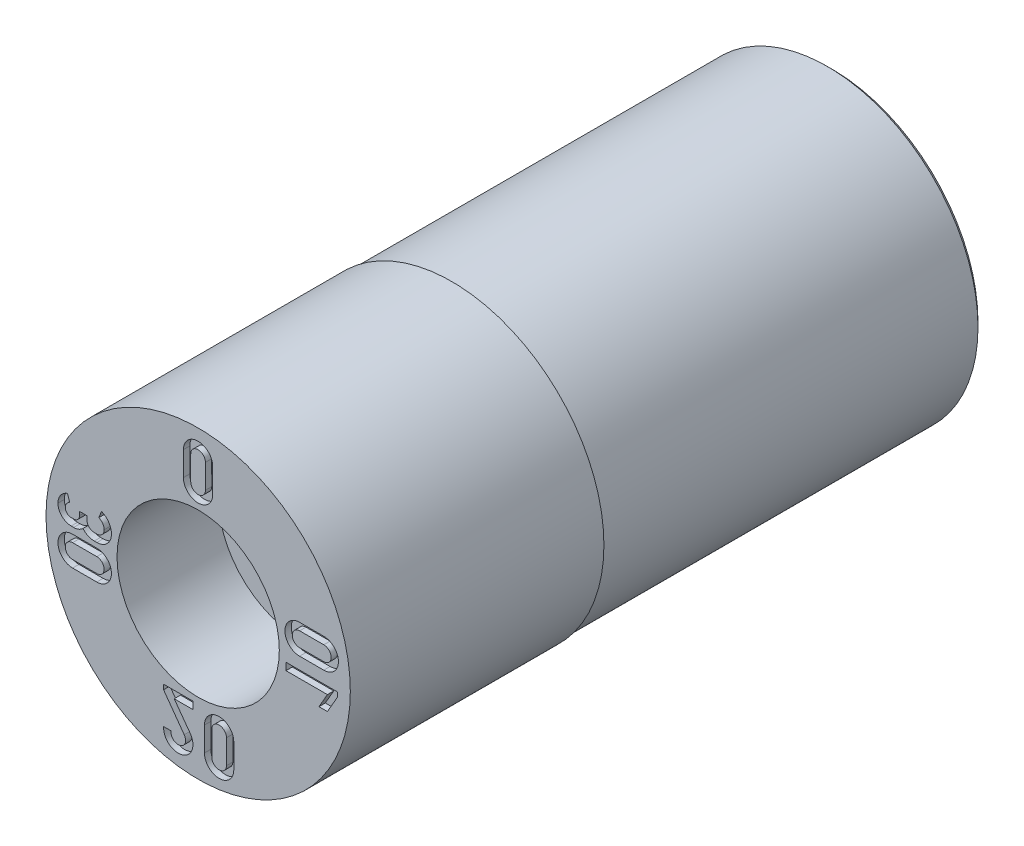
from build123d import *

# Parameters (mm, degrees)
SKETCH4_W          = 15
SKETCH4_H          = 1
CUT_EXTRUDE1_DEPTH = 0.25
CUT_EXTRUDE2_DEPTH = 3


with BuildPart() as part:
    # Sketch1 → Revolve1 (revolve)
    with BuildSketch(Plane(origin=(0, 0, 0), x_dir=(0, 0, -1), z_dir=(1, 0, 0)), mode=Mode.PRIVATE) as revolve1_sk:
        Polygon((0, 6), (0, 3.2), (4, 3.2), (4, 1.5), (19, 1.5), (19, 3), (25, 3), (25, 5.75), (24.75, 6), align=None)
    revolve(revolve1_sk.sketch.rotate(Axis((0, 0, 3.797909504), (0, 0, -1)), 90), axis=Axis((0, 0, 3.797909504), (0, 0, -1)))

    # Sketch4 → Cut-Revolve1 (revolve, cut)
    with BuildSketch(Plane(origin=(0, 0, 0), x_dir=(0, 0, -1), z_dir=(1, 0, 0)), mode=Mode.PRIVATE) as cut_revolve1_sk:
        with Locations((17.5, 6.435)):
            Rectangle(SKETCH4_W, SKETCH4_H)
    revolve(cut_revolve1_sk.sketch.rotate(Axis((0, 0, 0), (0, 0, -1)), 90), axis=Axis((0, 0, 0), (0, 0, -1)), mode=Mode.SUBTRACT)

    # Sketch2 → Cut-Extrude1 (cut)
    # profile 1 of 7: a face of its own
    with BuildSketch(Plane.XY):
        with BuildLine():
            Line((1.404681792, -4.976427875), (1.404763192, -4.022448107))
            ThreePointArc((1.404763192, -4.022448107), (0.826381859, -3.444103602), (0.248064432, -4.02251201))
            Line((0.248064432, -4.02251201), (0.248144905, -4.976525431))
            ThreePointArc((0.248144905, -4.976525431), (0.826462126, -5.554745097), (1.404681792, -4.976427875))
        make_face()
        with BuildLine():
            Line((0.537279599, -4.022487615), (0.537360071, -4.976501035))
            ThreePointArc((0.537360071, -4.976501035), (0.82643773, -5.26552993), (1.115466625, -4.976452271))
            Line((1.115466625, -4.976452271), (1.115548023, -4.02241835))
            ThreePointArc((1.115548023, -4.02241835), (0.826379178, -3.73331877), (0.537279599, -4.022487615))
        make_face(mode=Mode.SUBTRACT)
    # profile 2 of 7: a face of its own
    with BuildSketch(Plane.XY):
        with BuildLine():
            Line((-3.996502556, 0.377197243), (-4.097685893, 0.377205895))
            ThreePointArc((-4.097685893, 0.377205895), (-4.302045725, 0.461874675), (-4.386679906, 0.666248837))
            Line((-4.386679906, 0.666248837), (-4.38666755, 0.810770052))
            Line((-4.38666755, 0.810770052), (-4.675801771, 0.810794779))
            Line((-4.675801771, 0.810794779), (-4.675814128, 0.666308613))
            ThreePointArc((-4.675814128, 0.666308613), (-4.743562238, 0.50278972), (-4.907092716, 0.43506958))
            Line((-4.907092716, 0.43506958), (-5.008262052, 0.435078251))
            ThreePointArc((-5.008262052, 0.435078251), (-5.171723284, 0.502883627), (-5.23951242, 0.666351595))
            ThreePointArc((-5.23951242, 0.666351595), (-5.190773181, 0.81807853), (-5.062626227, 0.912814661))
            Line((-5.062626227, 0.912814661), (-5.155123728, 1.18674264))
            ThreePointArc((-5.155123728, 1.18674264), (-5.425530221, 0.986635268), (-5.528612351, 0.666421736))
            ThreePointArc((-5.528612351, 0.666421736), (-5.376258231, 0.298385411), (-5.008258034, 0.145944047))
            Line((-5.008258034, 0.145944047), (-4.907117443, 0.145935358))
            ThreePointArc((-4.907117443, 0.145935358), (-4.709605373, 0.18487619), (-4.541673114, 0.295899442))
            ThreePointArc((-4.541673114, 0.295899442), (-4.34281211, 0.142582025), (-4.097698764, 0.088071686))
            Line((-4.097698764, 0.088071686), (-3.996478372, 0.088063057))
            ThreePointArc((-3.996478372, 0.088063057), (-3.587664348, 0.257375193), (-3.418339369, 0.666183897))
            ThreePointArc((-3.418339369, 0.666183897), (-3.52602414, 1.015866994), (-3.811743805, 1.244424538))
            Line((-3.811743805, 1.244424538), (-3.917838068, 0.975585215))
            ThreePointArc((-3.917838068, 0.975585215), (-3.764984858, 0.85332605), (-3.707392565, 0.666257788))
            ThreePointArc((-3.707392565, 0.666257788), (-3.792081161, 0.461850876), (-3.996502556, 0.377197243))
        make_face()
    # profile 3 of 7: a face of its own
    with BuildSketch(Plane.XY):
        with BuildLine():
            Line((4.95360659, 1.3606148), (3.999616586, 1.360533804))
            ThreePointArc((3.999616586, 1.360533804), (3.421397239, 0.782227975), (3.999691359, 0.203996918))
            Line((3.999691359, 0.203996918), (4.95370478, 0.204077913))
            ThreePointArc((4.95370478, 0.204077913), (5.531924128, 0.782395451), (4.95360659, 1.3606148))
        make_face()
        with BuildLine():
            Line((3.999666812, 0.493131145), (4.953680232, 0.493212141))
            ThreePointArc((4.953680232, 0.493212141), (5.242789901, 0.782370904), (4.953631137, 1.071480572))
            Line((4.953631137, 1.071480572), (3.99959723, 1.071399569))
            ThreePointArc((3.99959723, 1.071399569), (3.710531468, 0.782230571), (3.999666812, 0.493131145))
        make_face(mode=Mode.SUBTRACT)
    # profile 4 of 7: a face of its own
    with BuildSketch(Plane.XY):
        Polygon((5.486509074, -0.269745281), (5.486525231, -0.460046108), (5.097319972, -1.137019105), (4.763909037, -1.137047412), (5.096218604, -0.558831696), (3.462917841, -0.558970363), (3.4628933, -0.269917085), align=None)
    # profile 5 of 7: a face of its own
    with BuildSketch(Plane.XY):
        with BuildLine():
            Line((-0.206933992, -3.722037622), (-0.206958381, -3.432899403))
            Line((-0.206958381, -3.432899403), (-1.363333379, -3.432996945))
            Line((-1.363333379, -3.432996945), (-1.363317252, -3.624188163))
            Line((-1.363317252, -3.624188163), (-0.550295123, -4.752730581))
            ThreePointArc((-0.550295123, -4.752730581), (-0.717056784, -5.202848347), (-1.070814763, -4.878393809))
            Line((-1.070814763, -4.878393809), (-1.361592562, -4.878425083))
            ThreePointArc((-1.361592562, -4.878425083), (-0.627826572, -5.478163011), (-0.315349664, -4.583480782))
            Line((-0.315349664, -4.583480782), (-0.944176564, -3.72209981))
            Line((-0.944176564, -3.72209981), (-0.206933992, -3.722037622))
        make_face()
    # profile 6 of 7: a face of its own
    with BuildSketch(Plane.XY):
        with BuildLine():
            Line((-0.581623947, 4.966644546), (-0.581543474, 4.012654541))
            ThreePointArc((-0.581543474, 4.012654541), (-0.003335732, 3.434482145), (0.574831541, 4.012695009))
            Line((0.574831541, 4.012695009), (0.57491294, 4.966742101))
            ThreePointArc((0.57491294, 4.966742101), (-0.003404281, 5.544961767), (-0.581623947, 4.966644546))
        make_face()
        with BuildLine():
            Line((0.285778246, 4.012704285), (0.285697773, 4.966717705))
            ThreePointArc((0.285697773, 4.966717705), (-0.003379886, 5.255746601), (-0.292408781, 4.966668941))
            Line((-0.292408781, 4.966668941), (-0.292490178, 4.01263502))
            ThreePointArc((-0.292490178, 4.01263502), (-0.003321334, 3.723535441), (0.285778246, 4.012704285))
        make_face(mode=Mode.SUBTRACT)
    # profile 7 of 7: a face of its own
    with BuildSketch(Plane.XY):
        with BuildLine():
            Line((-4.951192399, -0.104927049), (-3.997202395, -0.105008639))
            ThreePointArc((-3.997202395, -0.105008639), (-3.418971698, -0.683314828), (-3.997277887, -1.261545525))
            Line((-3.997277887, -1.261545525), (-4.951291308, -1.261463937))
            ThreePointArc((-4.951291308, -1.261463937), (-5.529510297, -0.683146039), (-4.951192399, -0.104927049))
        make_face()
        with BuildLine():
            Line((-3.997285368, -0.972492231), (-4.951266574, -0.97224877))
            ThreePointArc((-4.951266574, -0.97224877), (-5.240295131, -0.683170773), (-4.951217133, -0.394142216))
            Line((-4.951217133, -0.394142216), (-3.997183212, -0.394061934))
            ThreePointArc((-3.997183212, -0.394061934), (-3.708024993, -0.68332816), (-3.997285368, -0.972492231))
        make_face(mode=Mode.SUBTRACT)
    extrude(amount=-CUT_EXTRUDE1_DEPTH, mode=Mode.SUBTRACT)

    # Sketch3 → Cut-Extrude2 (cut)
    with BuildSketch(Plane.XY.offset(-4)):
        Polygon((0.866025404, 1.5), (-0.866025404, 1.5), (-1.732050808, 0), (-0.866025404, -1.5), (0.866025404, -1.5), (1.732050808, 0), align=None)
    extrude(amount=-CUT_EXTRUDE2_DEPTH, mode=Mode.SUBTRACT)


solid = part.part
